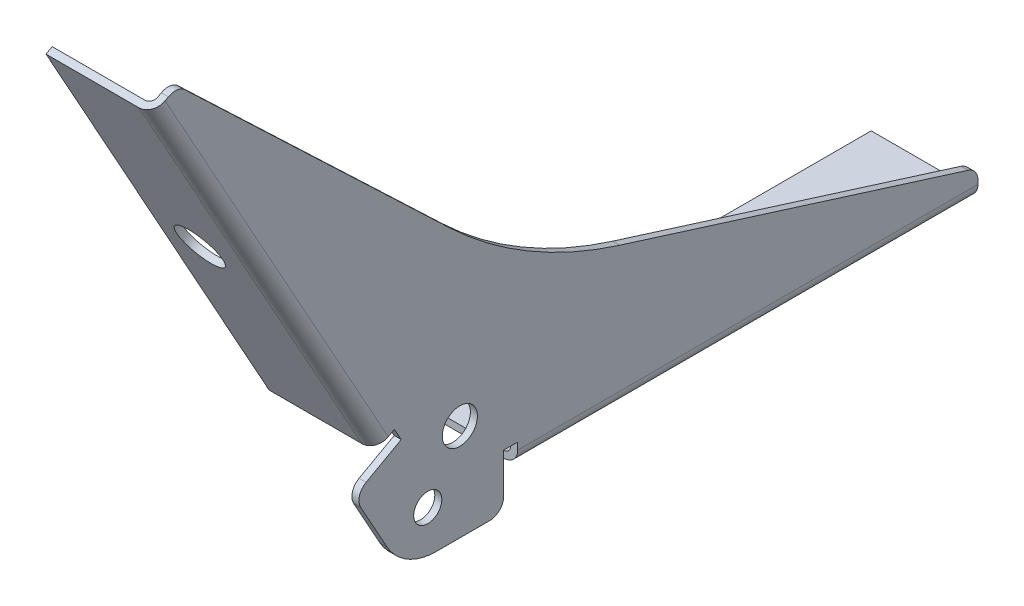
ISO-10303-21;
HEADER;
FILE_DESCRIPTION(('STEP AP214'),'2;1');
FILE_NAME('part.step','',(''),(''),'','','');
FILE_SCHEMA(('AUTOMOTIVE_DESIGN { 1 0 10303 214 1 1 1 1 }'));
ENDSEC;
DATA;
#1=APPLICATION_CONTEXT('core data for automotive mechanical design processes');
#2=APPLICATION_PROTOCOL_DEFINITION('international standard','automotive_design',2000,#1);
#3=PRODUCT_CONTEXT('',#1,'mechanical');
#4=PRODUCT('Part','Part','',(#3));
#5=PRODUCT_RELATED_PRODUCT_CATEGORY('part','',(#4));
#6=PRODUCT_DEFINITION_FORMATION('','',#4);
#7=PRODUCT_DEFINITION_CONTEXT('part definition',#1,'design');
#8=PRODUCT_DEFINITION('design','',#6,#7);
#9=PRODUCT_DEFINITION_SHAPE('','',#8);
#10=(LENGTH_UNIT() NAMED_UNIT(*) SI_UNIT(.MILLI.,.METRE.));
#11=(NAMED_UNIT(*) PLANE_ANGLE_UNIT() SI_UNIT($,.RADIAN.));
#12=(NAMED_UNIT(*) SI_UNIT($,.STERADIAN.) SOLID_ANGLE_UNIT());
#13=UNCERTAINTY_MEASURE_WITH_UNIT(LENGTH_MEASURE(1.E-05),#10,'distance_accuracy_value','');
#14=(GEOMETRIC_REPRESENTATION_CONTEXT(3) GLOBAL_UNCERTAINTY_ASSIGNED_CONTEXT((#13)) GLOBAL_UNIT_ASSIGNED_CONTEXT((#10,
#11,#12)) REPRESENTATION_CONTEXT('',''));
#15=CARTESIAN_POINT('',(0.,0.,0.));
#16=DIRECTION('',(0.,0.,1.));
#17=DIRECTION('',(1.,0.,0.));
#18=AXIS2_PLACEMENT_3D('',#15,#16,#17);
#19=CARTESIAN_POINT('',(14.2,-3.7,-9.));
#20=DIRECTION('',(-1.,0.,0.));
#21=DIRECTION('',(0.,0.,1.));
#22=AXIS2_PLACEMENT_3D('',#19,#20,#21);
#23=PLANE('',#22);
#24=CARTESIAN_POINT('',(14.2,0.331404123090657,-0.195211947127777));
#25=DIRECTION('',(1.,0.,0.));
#26=DIRECTION('',(0.,0.,-1.));
#27=AXIS2_PLACEMENT_3D('',#24,#25,#26);
#28=CIRCLE('',#27,2.);
#29=CARTESIAN_POINT('',(14.2,0.331404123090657,-2.19521194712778));
#30=VERTEX_POINT('',#29);
#31=EDGE_CURVE('E264',#30,#30,#28,.T.);
#32=ORIENTED_EDGE('',*,*,#31,.T.);
#33=EDGE_LOOP('',(#32));
#34=FACE_BOUND('',#33,.T.);
#35=CARTESIAN_POINT('',(14.2,8.08606656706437,-4.76305721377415));
#36=DIRECTION('',(1.,0.,0.));
#37=DIRECTION('',(0.,0.,-1.));
#38=AXIS2_PLACEMENT_3D('',#35,#36,#37);
#39=CIRCLE('',#38,2.5);
#40=CARTESIAN_POINT('',(14.2,8.08606656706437,-7.26305721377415));
#41=VERTEX_POINT('',#40);
#42=EDGE_CURVE('E258',#41,#41,#39,.T.);
#43=ORIENTED_EDGE('',*,*,#42,.T.);
#44=EDGE_LOOP('',(#43));
#45=FACE_BOUND('',#44,.T.);
#46=DIRECTION('',(0.,0.484809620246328,-0.874619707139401));
#47=VECTOR('',#46,1.);
#48=CARTESIAN_POINT('',(14.2,10.8852465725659,7.17714477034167));
#49=LINE('',#48,#47);
#50=CARTESIAN_POINT('',(14.2,11.8548658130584,5.42790535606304));
#51=VERTEX_POINT('',#50);
#52=CARTESIAN_POINT('',(14.2,12.3396754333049,4.55328564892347));
#53=VERTEX_POINT('',#52);
#54=EDGE_CURVE('E293',#51,#53,#49,.T.);
#55=ORIENTED_EDGE('',*,*,#54,.F.);
#56=DIRECTION('',(0.,0.874619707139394,0.484809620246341));
#57=VECTOR('',#56,1.);
#58=CARTESIAN_POINT('',(14.2,-6.16175745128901,-4.55887199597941));
#59=LINE('',#58,#57);
#60=CARTESIAN_POINT('',(14.2,69.1424566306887,37.1829354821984));
#61=VERTEX_POINT('',#60);
#62=EDGE_CURVE('E446',#51,#61,#59,.T.);
#63=ORIENTED_EDGE('',*,*,#62,.T.);
#64=DIRECTION('',(0.,-0.484809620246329,0.874619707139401));
#65=VECTOR('',#64,1.);
#66=CARTESIAN_POINT('',(14.2,68.1728373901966,38.9321748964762));
#67=LINE('',#66,#65);
#68=CARTESIAN_POINT('',(14.2,69.4000538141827,36.7182178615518));
#69=VERTEX_POINT('',#68);
#70=EDGE_CURVE('E290',#69,#61,#67,.T.);
#71=ORIENTED_EDGE('',*,*,#70,.F.);
#72=CARTESIAN_POINT('',(14.2,67.650814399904,35.7485986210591));
#73=DIRECTION('',(1.,0.,0.));
#74=DIRECTION('',(0.,0.,-1.));
#75=AXIS2_PLACEMENT_3D('',#72,#73,#74);
#76=CIRCLE('',#75,1.99999999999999);
#77=CARTESIAN_POINT('',(14.2,69.0995906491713,34.3698138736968));
#78=VERTEX_POINT('',#77);
#79=EDGE_CURVE('E287',#78,#69,#76,.T.);
#80=ORIENTED_EDGE('',*,*,#79,.F.);
#81=DIRECTION('',(0.,0.689392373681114,0.724388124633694));
#82=VECTOR('',#81,1.);
#83=CARTESIAN_POINT('',(14.2,69.0995906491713,34.3698138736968));
#84=LINE('',#83,#82);
#85=CARTESIAN_POINT('',(14.2,33.2634247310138,-3.28550987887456));
#86=VERTEX_POINT('',#85);
#87=EDGE_CURVE('E284',#86,#78,#84,.T.);
#88=ORIENTED_EDGE('',*,*,#87,.F.);
#89=CARTESIAN_POINT('',(14.2,78.2335200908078,-46.083065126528));
#90=DIRECTION('',(-1.,0.,0.));
#91=DIRECTION('',(0.,0.,-1.));
#92=AXIS2_PLACEMENT_3D('',#89,#90,#91);
#93=CIRCLE('',#92,62.080111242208);
#94=CARTESIAN_POINT('',(14.2,19.,-27.5));
#95=VERTEX_POINT('',#94);
#96=EDGE_CURVE('E281',#95,#86,#93,.T.);
#97=ORIENTED_EDGE('',*,*,#96,.F.);
#98=DIRECTION('',(0.,0.299340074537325,0.954146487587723));
#99=VECTOR('',#98,1.);
#100=CARTESIAN_POINT('',(14.2,3.43962975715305,-77.0986801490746));
#101=LINE('',#100,#99);
#102=CARTESIAN_POINT('',(14.2,3.43962975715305,-77.0986801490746));
#103=VERTEX_POINT('',#102);
#104=EDGE_CURVE('E278',#103,#95,#101,.T.);
#105=ORIENTED_EDGE('',*,*,#104,.F.);
#106=CARTESIAN_POINT('',(14.2,1.5313367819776,-76.5));
#107=DIRECTION('',(1.,0.,0.));
#108=DIRECTION('',(0.,0.,-1.));
#109=AXIS2_PLACEMENT_3D('',#106,#107,#108);
#110=CIRCLE('',#109,2.);
#111=CARTESIAN_POINT('',(14.2,1.53133678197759,-78.5));
#112=VERTEX_POINT('',#111);
#113=EDGE_CURVE('E275',#112,#103,#110,.T.);
#114=ORIENTED_EDGE('',*,*,#113,.F.);
#115=DIRECTION('',(0.,1.,0.));
#116=VECTOR('',#115,1.);
#117=CARTESIAN_POINT('',(14.2,-1.,-78.5));
#118=LINE('',#117,#116);
#119=CARTESIAN_POINT('',(14.2,1.,-78.5));
#120=VERTEX_POINT('',#119);
#121=EDGE_CURVE('E272',#120,#112,#118,.T.);
#122=ORIENTED_EDGE('',*,*,#121,.F.);
#123=DIRECTION('',(0.,0.,-1.));
#124=VECTOR('',#123,1.);
#125=CARTESIAN_POINT('',(14.2,1.,-9.));
#126=LINE('',#125,#124);
#127=CARTESIAN_POINT('',(14.2,1.,-13.));
#128=VERTEX_POINT('',#127);
#129=EDGE_CURVE('E444',#120,#128,#126,.F.);
#130=ORIENTED_EDGE('',*,*,#129,.T.);
#131=DIRECTION('',(0.,-1.,0.));
#132=VECTOR('',#131,1.);
#133=CARTESIAN_POINT('',(14.2,-1.,-13.));
#134=LINE('',#133,#132);
#135=CARTESIAN_POINT('',(14.2,2.,-13.));
#136=VERTEX_POINT('',#135);
#137=EDGE_CURVE('E270',#136,#128,#134,.T.);
#138=ORIENTED_EDGE('',*,*,#137,.F.);
#139=DIRECTION('',(0.,0.,-1.));
#140=VECTOR('',#139,1.);
#141=CARTESIAN_POINT('',(14.2,2.,-13.));
#142=LINE('',#141,#140);
#143=CARTESIAN_POINT('',(14.2,2.,-11.));
#144=VERTEX_POINT('',#143);
#145=EDGE_CURVE('E319',#144,#136,#142,.T.);
#146=ORIENTED_EDGE('',*,*,#145,.F.);
#147=DIRECTION('',(0.,1.,0.));
#148=VECTOR('',#147,1.);
#149=CARTESIAN_POINT('',(14.2,2.,-11.));
#150=LINE('',#149,#148);
#151=CARTESIAN_POINT('',(14.2,-3.69999999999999,-11.));
#152=VERTEX_POINT('',#151);
#153=EDGE_CURVE('E316',#152,#144,#150,.T.);
#154=ORIENTED_EDGE('',*,*,#153,.F.);
#155=CARTESIAN_POINT('',(14.2,-3.7,-9.));
#156=DIRECTION('',(1.,0.,0.));
#157=DIRECTION('',(0.,0.,1.));
#158=AXIS2_PLACEMENT_3D('',#155,#156,#157);
#159=CIRCLE('',#158,2.);
#160=CARTESIAN_POINT('',(14.2,-5.7,-8.99999999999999));
#161=VERTEX_POINT('',#160);
#162=EDGE_CURVE('E313',#161,#152,#159,.T.);
#163=ORIENTED_EDGE('',*,*,#162,.F.);
#164=DIRECTION('',(0.,0.,-1.));
#165=VECTOR('',#164,1.);
#166=CARTESIAN_POINT('',(14.2,-5.7,-8.99999999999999));
#167=LINE('',#166,#165);
#168=CARTESIAN_POINT('',(14.2,-5.7,-1.35480353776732));
#169=VERTEX_POINT('',#168);
#170=EDGE_CURVE('E310',#169,#161,#167,.T.);
#171=ORIENTED_EDGE('',*,*,#170,.F.);
#172=CARTESIAN_POINT('',(14.2,2.3,-1.35480353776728));
#173=DIRECTION('',(1.,0.,0.));
#174=DIRECTION('',(0.,0.,1.));
#175=AXIS2_PLACEMENT_3D('',#172,#173,#174);
#176=CIRCLE('',#175,8.);
#177=CARTESIAN_POINT('',(14.2,-1.5784769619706,5.64215411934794));
#178=VERTEX_POINT('',#177);
#179=EDGE_CURVE('E307',#178,#169,#176,.T.);
#180=ORIENTED_EDGE('',*,*,#179,.F.);
#181=DIRECTION('',(0.,-0.874619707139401,-0.484809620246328));
#182=VECTOR('',#181,1.);
#183=CARTESIAN_POINT('',(14.2,5.10816252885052,9.34861891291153));
#184=LINE('',#183,#182);
#185=CARTESIAN_POINT('',(14.2,5.10816252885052,9.34861891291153));
#186=VERTEX_POINT('',#185);
#187=EDGE_CURVE('E304',#186,#178,#184,.T.);
#188=ORIENTED_EDGE('',*,*,#187,.F.);
#189=CARTESIAN_POINT('',(14.2,6.07778176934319,7.59937949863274));
#190=DIRECTION('',(1.,0.,0.));
#191=DIRECTION('',(0.,0.,-1.));
#192=AXIS2_PLACEMENT_3D('',#189,#190,#191);
#193=CIRCLE('',#192,2.);
#194=CARTESIAN_POINT('',(14.2,7.827021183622,8.56899873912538));
#195=VERTEX_POINT('',#194);
#196=EDGE_CURVE('E301',#195,#186,#193,.T.);
#197=ORIENTED_EDGE('',*,*,#196,.F.);
#198=DIRECTION('',(0.,-0.484809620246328,0.874619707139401));
#199=VECTOR('',#198,1.);
#200=CARTESIAN_POINT('',(14.2,10.5904360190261,3.58366640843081));
#201=LINE('',#200,#199);
#202=CARTESIAN_POINT('',(14.2,10.5904360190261,3.58366640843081));
#203=VERTEX_POINT('',#202);
#204=EDGE_CURVE('E298',#203,#195,#201,.T.);
#205=ORIENTED_EDGE('',*,*,#204,.F.);
#206=DIRECTION('',(0.,-0.8746197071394,-0.484809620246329));
#207=VECTOR('',#206,1.);
#208=CARTESIAN_POINT('',(14.2,12.3396754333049,4.55328564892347));
#209=LINE('',#208,#207);
#210=EDGE_CURVE('E295',#53,#203,#209,.T.);
#211=ORIENTED_EDGE('',*,*,#210,.F.);
#212=EDGE_LOOP('',(#55,#63,#71,#80,#88,#97,#105,#114,#122,#130,#138,#146,#154,#163,#171,#180,
#188,#197,#205,#211));
#213=FACE_BOUND('',#212,.T.);
#214=ADVANCED_FACE('F34',(#34,#45,#213),#23,.T.);
#215=CARTESIAN_POINT('',(15.2,-1.,-13.));
#216=DIRECTION('',(0.,0.,-1.));
#217=DIRECTION('',(-1.,0.,0.));
#218=AXIS2_PLACEMENT_3D('',#215,#216,#217);
#219=PLANE('',#218);
#220=DIRECTION('',(-1.,0.,0.));
#221=VECTOR('',#220,1.);
#222=CARTESIAN_POINT('',(15.2,-1.,-13.));
#223=LINE('',#222,#221);
#224=CARTESIAN_POINT('',(13.2,-1.,-13.));
#225=VERTEX_POINT('',#224);
#226=CARTESIAN_POINT('',(0.,-1.,-13.));
#227=VERTEX_POINT('',#226);
#228=EDGE_CURVE('E425',#225,#227,#223,.T.);
#229=ORIENTED_EDGE('',*,*,#228,.F.);
#230=CARTESIAN_POINT('',(13.2,0.999999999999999,-13.));
#231=DIRECTION('',(0.,0.,-1.));
#232=DIRECTION('',(-1.,0.,0.));
#233=AXIS2_PLACEMENT_3D('',#230,#231,#232);
#234=CIRCLE('',#233,2.);
#235=CARTESIAN_POINT('',(15.2,0.999999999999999,-13.));
#236=VERTEX_POINT('',#235);
#237=EDGE_CURVE('E442',#225,#236,#234,.F.);
#238=ORIENTED_EDGE('',*,*,#237,.T.);
#239=DIRECTION('',(0.,-1.,0.));
#240=VECTOR('',#239,1.);
#241=CARTESIAN_POINT('',(15.2,-1.,-13.));
#242=LINE('',#241,#240);
#243=CARTESIAN_POINT('',(15.2,2.,-13.));
#244=VERTEX_POINT('',#243);
#245=EDGE_CURVE('E403',#244,#236,#242,.T.);
#246=ORIENTED_EDGE('',*,*,#245,.F.);
#247=DIRECTION('',(1.,0.,0.));
#248=VECTOR('',#247,1.);
#249=CARTESIAN_POINT('',(14.2,2.,-13.));
#250=LINE('',#249,#248);
#251=EDGE_CURVE('E368',#136,#244,#250,.T.);
#252=ORIENTED_EDGE('',*,*,#251,.F.);
#253=ORIENTED_EDGE('',*,*,#137,.T.);
#254=CARTESIAN_POINT('',(13.2,1.,-13.));
#255=DIRECTION('',(0.,0.,-1.));
#256=DIRECTION('',(-1.,0.,0.));
#257=AXIS2_PLACEMENT_3D('',#254,#255,#256);
#258=CIRCLE('',#257,1.);
#259=CARTESIAN_POINT('',(13.2,0.,-13.));
#260=VERTEX_POINT('',#259);
#261=EDGE_CURVE('E11',#128,#260,#258,.T.);
#262=ORIENTED_EDGE('',*,*,#261,.T.);
#263=DIRECTION('',(-1.,0.,0.));
#264=VECTOR('',#263,1.);
#265=CARTESIAN_POINT('',(15.2,0.,-13.));
#266=LINE('',#265,#264);
#267=CARTESIAN_POINT('',(0.,0.,-13.));
#268=VERTEX_POINT('',#267);
#269=EDGE_CURVE('E409',#260,#268,#266,.T.);
#270=ORIENTED_EDGE('',*,*,#269,.T.);
#271=DIRECTION('',(0.,-1.,0.));
#272=VECTOR('',#271,1.);
#273=CARTESIAN_POINT('',(0.,-1.,-13.));
#274=LINE('',#273,#272);
#275=EDGE_CURVE('E371',#268,#227,#274,.T.);
#276=ORIENTED_EDGE('',*,*,#275,.T.);
#277=EDGE_LOOP('',(#229,#238,#246,#252,#253,#262,#270,#276));
#278=FACE_BOUND('',#277,.T.);
#279=ADVANCED_FACE('F472',(#278),#219,.F.);
#280=CARTESIAN_POINT('',(15.2,-1.,-13.));
#281=DIRECTION('',(0.,1.,0.));
#282=DIRECTION('',(0.,0.,1.));
#283=AXIS2_PLACEMENT_3D('',#280,#281,#282);
#284=PLANE('',#283);
#285=CARTESIAN_POINT('',(6.,-1.,-45.75));
#286=DIRECTION('',(0.,1.,0.));
#287=DIRECTION('',(0.,0.,1.));
#288=AXIS2_PLACEMENT_3D('',#285,#286,#287);
#289=CIRCLE('',#288,3.3);
#290=CARTESIAN_POINT('',(6.,-1.,-42.45));
#291=VERTEX_POINT('',#290);
#292=EDGE_CURVE('E785',#291,#291,#289,.T.);
#293=ORIENTED_EDGE('',*,*,#292,.T.);
#294=EDGE_LOOP('',(#293));
#295=FACE_BOUND('',#294,.T.);
#296=DIRECTION('',(-1.,0.,0.));
#297=VECTOR('',#296,1.);
#298=CARTESIAN_POINT('',(15.2,-1.,-78.5));
#299=LINE('',#298,#297);
#300=CARTESIAN_POINT('',(13.2,-1.,-78.5));
#301=VERTEX_POINT('',#300);
#302=CARTESIAN_POINT('',(0.,-1.,-78.5));
#303=VERTEX_POINT('',#302);
#304=EDGE_CURVE('E423',#301,#303,#299,.T.);
#305=ORIENTED_EDGE('',*,*,#304,.F.);
#306=DIRECTION('',(0.,0.,-1.));
#307=VECTOR('',#306,1.);
#308=CARTESIAN_POINT('',(13.2,-1.,-13.));
#309=LINE('',#308,#307);
#310=EDGE_CURVE('E440',#301,#225,#309,.F.);
#311=ORIENTED_EDGE('',*,*,#310,.T.);
#312=ORIENTED_EDGE('',*,*,#228,.T.);
#313=DIRECTION('',(0.,0.,-1.));
#314=VECTOR('',#313,1.);
#315=CARTESIAN_POINT('',(0.,-1.,-13.));
#316=LINE('',#315,#314);
#317=EDGE_CURVE('E412',#227,#303,#316,.T.);
#318=ORIENTED_EDGE('',*,*,#317,.T.);
#319=EDGE_LOOP('',(#305,#311,#312,#318));
#320=FACE_BOUND('',#319,.T.);
#321=ADVANCED_FACE('F480',(#295,#320),#284,.F.);
#322=CARTESIAN_POINT('',(15.2,-1.,-78.5));
#323=DIRECTION('',(0.,0.,1.));
#324=DIRECTION('',(0.,-1.,0.));
#325=AXIS2_PLACEMENT_3D('',#322,#323,#324);
#326=PLANE('',#325);
#327=DIRECTION('',(0.,1.,0.));
#328=VECTOR('',#327,1.);
#329=CARTESIAN_POINT('',(15.2,-1.,-78.5));
#330=LINE('',#329,#328);
#331=CARTESIAN_POINT('',(15.2,0.999999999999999,-78.5));
#332=VERTEX_POINT('',#331);
#333=CARTESIAN_POINT('',(15.2,1.53133678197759,-78.5));
#334=VERTEX_POINT('',#333);
#335=EDGE_CURVE('E406',#332,#334,#330,.T.);
#336=ORIENTED_EDGE('',*,*,#335,.F.);
#337=CARTESIAN_POINT('',(13.2,0.999999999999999,-78.5));
#338=DIRECTION('',(0.,0.,1.));
#339=DIRECTION('',(0.,-1.,0.));
#340=AXIS2_PLACEMENT_3D('',#337,#338,#339);
#341=CIRCLE('',#340,2.);
#342=EDGE_CURVE('E438',#332,#301,#341,.F.);
#343=ORIENTED_EDGE('',*,*,#342,.T.);
#344=ORIENTED_EDGE('',*,*,#304,.T.);
#345=DIRECTION('',(0.,1.,0.));
#346=VECTOR('',#345,1.);
#347=CARTESIAN_POINT('',(0.,-1.,-78.5));
#348=LINE('',#347,#346);
#349=CARTESIAN_POINT('',(0.,0.,-78.5));
#350=VERTEX_POINT('',#349);
#351=EDGE_CURVE('E415',#303,#350,#348,.T.);
#352=ORIENTED_EDGE('',*,*,#351,.T.);
#353=DIRECTION('',(-1.,0.,0.));
#354=VECTOR('',#353,1.);
#355=CARTESIAN_POINT('',(15.2,0.,-78.5));
#356=LINE('',#355,#354);
#357=CARTESIAN_POINT('',(13.2,0.,-78.5));
#358=VERTEX_POINT('',#357);
#359=EDGE_CURVE('E421',#358,#350,#356,.T.);
#360=ORIENTED_EDGE('',*,*,#359,.F.);
#361=CARTESIAN_POINT('',(13.2,1.,-78.5));
#362=DIRECTION('',(0.,0.,1.));
#363=DIRECTION('',(0.,-1.,0.));
#364=AXIS2_PLACEMENT_3D('',#361,#362,#363);
#365=CIRCLE('',#364,1.);
#366=EDGE_CURVE('E42',#358,#120,#365,.T.);
#367=ORIENTED_EDGE('',*,*,#366,.T.);
#368=ORIENTED_EDGE('',*,*,#121,.T.);
#369=DIRECTION('',(1.,0.,0.));
#370=VECTOR('',#369,1.);
#371=CARTESIAN_POINT('',(14.2,1.53133678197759,-78.5));
#372=LINE('',#371,#370);
#373=EDGE_CURVE('E322',#112,#334,#372,.T.);
#374=ORIENTED_EDGE('',*,*,#373,.T.);
#375=EDGE_LOOP('',(#336,#343,#344,#352,#360,#367,#368,#374));
#376=FACE_BOUND('',#375,.T.);
#377=ADVANCED_FACE('F460',(#376),#326,.F.);
#378=CARTESIAN_POINT('',(15.2,0.,-13.));
#379=DIRECTION('',(0.,-1.,0.));
#380=DIRECTION('',(0.,0.,-1.));
#381=AXIS2_PLACEMENT_3D('',#378,#379,#380);
#382=PLANE('',#381);
#383=CARTESIAN_POINT('',(6.,0.,-45.75));
#384=DIRECTION('',(0.,1.,0.));
#385=DIRECTION('',(0.,0.,1.));
#386=AXIS2_PLACEMENT_3D('',#383,#384,#385);
#387=CIRCLE('',#386,3.3);
#388=CARTESIAN_POINT('',(6.,0.,-42.45));
#389=VERTEX_POINT('',#388);
#390=EDGE_CURVE('E788',#389,#389,#387,.T.);
#391=ORIENTED_EDGE('',*,*,#390,.F.);
#392=EDGE_LOOP('',(#391));
#393=FACE_BOUND('',#392,.T.);
#394=ORIENTED_EDGE('',*,*,#269,.F.);
#395=DIRECTION('',(0.,0.,-1.));
#396=VECTOR('',#395,1.);
#397=CARTESIAN_POINT('',(13.2,0.,-13.));
#398=LINE('',#397,#396);
#399=EDGE_CURVE('E451',#260,#358,#398,.T.);
#400=ORIENTED_EDGE('',*,*,#399,.T.);
#401=ORIENTED_EDGE('',*,*,#359,.T.);
#402=DIRECTION('',(0.,0.,1.));
#403=VECTOR('',#402,1.);
#404=CARTESIAN_POINT('',(0.,0.,-13.));
#405=LINE('',#404,#403);
#406=EDGE_CURVE('E407',#350,#268,#405,.T.);
#407=ORIENTED_EDGE('',*,*,#406,.T.);
#408=EDGE_LOOP('',(#394,#400,#401,#407));
#409=FACE_BOUND('',#408,.T.);
#410=ADVANCED_FACE('F468',(#393,#409),#382,.F.);
#411=CARTESIAN_POINT('',(15.2,0.,0.));
#412=DIRECTION('',(-1.,0.,0.));
#413=DIRECTION('',(0.,0.,1.));
#414=AXIS2_PLACEMENT_3D('',#411,#412,#413);
#415=PLANE('',#414);
#416=DIRECTION('',(0.,-0.484809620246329,0.874619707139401));
#417=VECTOR('',#416,1.);
#418=CARTESIAN_POINT('',(15.2,68.1728373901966,38.9321748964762));
#419=LINE('',#418,#417);
#420=CARTESIAN_POINT('',(15.2,69.4000538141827,36.7182178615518));
#421=VERTEX_POINT('',#420);
#422=CARTESIAN_POINT('',(15.2,69.1424566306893,37.1829354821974));
#423=VERTEX_POINT('',#422);
#424=EDGE_CURVE('E337',#421,#423,#419,.T.);
#425=ORIENTED_EDGE('',*,*,#424,.T.);
#426=DIRECTION('',(0.,-0.874619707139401,-0.484809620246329));
#427=VECTOR('',#426,1.);
#428=CARTESIAN_POINT('',(15.2,11.8548658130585,5.42790535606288));
#429=LINE('',#428,#427);
#430=CARTESIAN_POINT('',(15.2,11.8548658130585,5.42790535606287));
#431=VERTEX_POINT('',#430);
#432=EDGE_CURVE('E430',#423,#431,#429,.T.);
#433=ORIENTED_EDGE('',*,*,#432,.T.);
#434=DIRECTION('',(0.,0.484809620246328,-0.874619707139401));
#435=VECTOR('',#434,1.);
#436=CARTESIAN_POINT('',(15.2,10.8852465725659,7.17714477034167));
#437=LINE('',#436,#435);
#438=CARTESIAN_POINT('',(15.2,12.3396754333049,4.55328564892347));
#439=VERTEX_POINT('',#438);
#440=EDGE_CURVE('E340',#431,#439,#437,.T.);
#441=ORIENTED_EDGE('',*,*,#440,.T.);
#442=DIRECTION('',(0.,-0.8746197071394,-0.484809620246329));
#443=VECTOR('',#442,1.);
#444=CARTESIAN_POINT('',(15.2,12.3396754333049,4.55328564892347));
#445=LINE('',#444,#443);
#446=CARTESIAN_POINT('',(15.2,10.5904360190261,3.58366640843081));
#447=VERTEX_POINT('',#446);
#448=EDGE_CURVE('E342',#439,#447,#445,.T.);
#449=ORIENTED_EDGE('',*,*,#448,.T.);
#450=DIRECTION('',(0.,-0.484809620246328,0.874619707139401));
#451=VECTOR('',#450,1.);
#452=CARTESIAN_POINT('',(15.2,10.5904360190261,3.58366640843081));
#453=LINE('',#452,#451);
#454=CARTESIAN_POINT('',(15.2,7.827021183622,8.56899873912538));
#455=VERTEX_POINT('',#454);
#456=EDGE_CURVE('E345',#447,#455,#453,.T.);
#457=ORIENTED_EDGE('',*,*,#456,.T.);
#458=CARTESIAN_POINT('',(15.2,6.07778176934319,7.59937949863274));
#459=DIRECTION('',(1.,0.,0.));
#460=DIRECTION('',(0.,0.,-1.));
#461=AXIS2_PLACEMENT_3D('',#458,#459,#460);
#462=CIRCLE('',#461,2.);
#463=CARTESIAN_POINT('',(15.2,5.10816252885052,9.34861891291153));
#464=VERTEX_POINT('',#463);
#465=EDGE_CURVE('E348',#455,#464,#462,.T.);
#466=ORIENTED_EDGE('',*,*,#465,.T.);
#467=DIRECTION('',(0.,-0.874619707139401,-0.484809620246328));
#468=VECTOR('',#467,1.);
#469=CARTESIAN_POINT('',(15.2,5.10816252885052,9.34861891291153));
#470=LINE('',#469,#468);
#471=CARTESIAN_POINT('',(15.2,-1.5784769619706,5.64215411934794));
#472=VERTEX_POINT('',#471);
#473=EDGE_CURVE('E351',#464,#472,#470,.T.);
#474=ORIENTED_EDGE('',*,*,#473,.T.);
#475=CARTESIAN_POINT('',(15.2,2.3,-1.35480353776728));
#476=DIRECTION('',(1.,0.,0.));
#477=DIRECTION('',(0.,0.,1.));
#478=AXIS2_PLACEMENT_3D('',#475,#476,#477);
#479=CIRCLE('',#478,8.);
#480=CARTESIAN_POINT('',(15.2,-5.7,-1.35480353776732));
#481=VERTEX_POINT('',#480);
#482=EDGE_CURVE('E354',#472,#481,#479,.T.);
#483=ORIENTED_EDGE('',*,*,#482,.T.);
#484=DIRECTION('',(0.,0.,-1.));
#485=VECTOR('',#484,1.);
#486=CARTESIAN_POINT('',(15.2,-5.7,-8.99999999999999));
#487=LINE('',#486,#485);
#488=CARTESIAN_POINT('',(15.2,-5.7,-8.99999999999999));
#489=VERTEX_POINT('',#488);
#490=EDGE_CURVE('E357',#481,#489,#487,.T.);
#491=ORIENTED_EDGE('',*,*,#490,.T.);
#492=CARTESIAN_POINT('',(15.2,-3.7,-9.));
#493=DIRECTION('',(1.,0.,0.));
#494=DIRECTION('',(0.,0.,1.));
#495=AXIS2_PLACEMENT_3D('',#492,#493,#494);
#496=CIRCLE('',#495,2.);
#497=CARTESIAN_POINT('',(15.2,-3.69999999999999,-11.));
#498=VERTEX_POINT('',#497);
#499=EDGE_CURVE('E360',#489,#498,#496,.T.);
#500=ORIENTED_EDGE('',*,*,#499,.T.);
#501=DIRECTION('',(0.,1.,0.));
#502=VECTOR('',#501,1.);
#503=CARTESIAN_POINT('',(15.2,2.,-11.));
#504=LINE('',#503,#502);
#505=CARTESIAN_POINT('',(15.2,2.,-11.));
#506=VERTEX_POINT('',#505);
#507=EDGE_CURVE('E363',#498,#506,#504,.T.);
#508=ORIENTED_EDGE('',*,*,#507,.T.);
#509=DIRECTION('',(0.,0.,-1.));
#510=VECTOR('',#509,1.);
#511=CARTESIAN_POINT('',(15.2,2.,-13.));
#512=LINE('',#511,#510);
#513=EDGE_CURVE('E273',#506,#244,#512,.T.);
#514=ORIENTED_EDGE('',*,*,#513,.T.);
#515=ORIENTED_EDGE('',*,*,#245,.T.);
#516=DIRECTION('',(0.,0.,-1.));
#517=VECTOR('',#516,1.);
#518=CARTESIAN_POINT('',(15.2,0.999999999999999,0.));
#519=LINE('',#518,#517);
#520=EDGE_CURVE('E427',#236,#332,#519,.T.);
#521=ORIENTED_EDGE('',*,*,#520,.T.);
#522=ORIENTED_EDGE('',*,*,#335,.T.);
#523=CARTESIAN_POINT('',(15.2,1.5313367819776,-76.5));
#524=DIRECTION('',(1.,0.,0.));
#525=DIRECTION('',(0.,0.,-1.));
#526=AXIS2_PLACEMENT_3D('',#523,#524,#525);
#527=CIRCLE('',#526,2.);
#528=CARTESIAN_POINT('',(15.2,3.43962975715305,-77.0986801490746));
#529=VERTEX_POINT('',#528);
#530=EDGE_CURVE('E267',#334,#529,#527,.T.);
#531=ORIENTED_EDGE('',*,*,#530,.T.);
#532=DIRECTION('',(0.,0.299340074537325,0.954146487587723));
#533=VECTOR('',#532,1.);
#534=CARTESIAN_POINT('',(15.2,3.43962975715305,-77.0986801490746));
#535=LINE('',#534,#533);
#536=CARTESIAN_POINT('',(15.2,19.,-27.5));
#537=VERTEX_POINT('',#536);
#538=EDGE_CURVE('E325',#529,#537,#535,.T.);
#539=ORIENTED_EDGE('',*,*,#538,.T.);
#540=CARTESIAN_POINT('',(15.2,78.2335200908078,-46.083065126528));
#541=DIRECTION('',(-1.,0.,0.));
#542=DIRECTION('',(0.,0.,-1.));
#543=AXIS2_PLACEMENT_3D('',#540,#541,#542);
#544=CIRCLE('',#543,62.080111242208);
#545=CARTESIAN_POINT('',(15.2,33.2634247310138,-3.28550987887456));
#546=VERTEX_POINT('',#545);
#547=EDGE_CURVE('E328',#537,#546,#544,.T.);
#548=ORIENTED_EDGE('',*,*,#547,.T.);
#549=DIRECTION('',(0.,0.689392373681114,0.724388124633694));
#550=VECTOR('',#549,1.);
#551=CARTESIAN_POINT('',(15.2,69.0995906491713,34.3698138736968));
#552=LINE('',#551,#550);
#553=CARTESIAN_POINT('',(15.2,69.0995906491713,34.3698138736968));
#554=VERTEX_POINT('',#553);
#555=EDGE_CURVE('E331',#546,#554,#552,.T.);
#556=ORIENTED_EDGE('',*,*,#555,.T.);
#557=CARTESIAN_POINT('',(15.2,67.650814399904,35.7485986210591));
#558=DIRECTION('',(1.,0.,0.));
#559=DIRECTION('',(0.,0.,-1.));
#560=AXIS2_PLACEMENT_3D('',#557,#558,#559);
#561=CIRCLE('',#560,1.99999999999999);
#562=EDGE_CURVE('E334',#554,#421,#561,.T.);
#563=ORIENTED_EDGE('',*,*,#562,.T.);
#564=EDGE_LOOP('',(#425,#433,#441,#449,#457,#466,#474,#483,#491,#500,#508,#514,#515,#521,#522,
#531,#539,#548,#556,#563));
#565=FACE_BOUND('',#564,.T.);
#566=CARTESIAN_POINT('',(15.2,0.331404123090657,-0.195211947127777));
#567=DIRECTION('',(1.,0.,0.));
#568=DIRECTION('',(0.,0.,-1.));
#569=AXIS2_PLACEMENT_3D('',#566,#567,#568);
#570=CIRCLE('',#569,2.);
#571=CARTESIAN_POINT('',(15.2,0.331404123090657,-2.19521194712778));
#572=VERTEX_POINT('',#571);
#573=EDGE_CURVE('E261',#572,#572,#570,.T.);
#574=ORIENTED_EDGE('',*,*,#573,.F.);
#575=EDGE_LOOP('',(#574));
#576=FACE_BOUND('',#575,.T.);
#577=CARTESIAN_POINT('',(15.2,8.08606656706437,-4.76305721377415));
#578=DIRECTION('',(1.,0.,0.));
#579=DIRECTION('',(0.,0.,-1.));
#580=AXIS2_PLACEMENT_3D('',#577,#578,#579);
#581=CIRCLE('',#580,2.5);
#582=CARTESIAN_POINT('',(15.2,8.08606656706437,-7.26305721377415));
#583=VERTEX_POINT('',#582);
#584=EDGE_CURVE('E257',#583,#583,#581,.T.);
#585=ORIENTED_EDGE('',*,*,#584,.F.);
#586=EDGE_LOOP('',(#585));
#587=FACE_BOUND('',#586,.T.);
#588=ADVANCED_FACE('F486',(#565,#576,#587),#415,.F.);
#589=CARTESIAN_POINT('',(0.,0.,0.));
#590=DIRECTION('',(-1.,0.,0.));
#591=DIRECTION('',(0.,0.,1.));
#592=AXIS2_PLACEMENT_3D('',#589,#590,#591);
#593=PLANE('',#592);
#594=ORIENTED_EDGE('',*,*,#275,.F.);
#595=ORIENTED_EDGE('',*,*,#406,.F.);
#596=ORIENTED_EDGE('',*,*,#351,.F.);
#597=ORIENTED_EDGE('',*,*,#317,.F.);
#598=EDGE_LOOP('',(#594,#595,#596,#597));
#599=FACE_BOUND('',#598,.T.);
#600=ADVANCED_FACE('F476',(#599),#593,.T.);
#601=CARTESIAN_POINT('',(14.2,2.,-13.));
#602=DIRECTION('',(0.,-1.,0.));
#603=DIRECTION('',(0.,0.,-1.));
#604=AXIS2_PLACEMENT_3D('',#601,#602,#603);
#605=PLANE('',#604);
#606=ORIENTED_EDGE('',*,*,#513,.F.);
#607=DIRECTION('',(1.,0.,0.));
#608=VECTOR('',#607,1.);
#609=CARTESIAN_POINT('',(14.2,2.,-11.));
#610=LINE('',#609,#608);
#611=EDGE_CURVE('E372',#144,#506,#610,.T.);
#612=ORIENTED_EDGE('',*,*,#611,.F.);
#613=ORIENTED_EDGE('',*,*,#145,.T.);
#614=ORIENTED_EDGE('',*,*,#251,.T.);
#615=EDGE_LOOP('',(#606,#612,#613,#614));
#616=FACE_BOUND('',#615,.T.);
#617=ADVANCED_FACE('F491',(#616),#605,.T.);
#618=CARTESIAN_POINT('',(14.2,2.,-11.));
#619=DIRECTION('',(0.,0.,-1.));
#620=DIRECTION('',(0.,1.,0.));
#621=AXIS2_PLACEMENT_3D('',#618,#619,#620);
#622=PLANE('',#621);
#623=ORIENTED_EDGE('',*,*,#507,.F.);
#624=DIRECTION('',(1.,0.,0.));
#625=VECTOR('',#624,1.);
#626=CARTESIAN_POINT('',(14.2,-3.69999999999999,-11.));
#627=LINE('',#626,#625);
#628=EDGE_CURVE('E374',#152,#498,#627,.T.);
#629=ORIENTED_EDGE('',*,*,#628,.F.);
#630=ORIENTED_EDGE('',*,*,#153,.T.);
#631=ORIENTED_EDGE('',*,*,#611,.T.);
#632=EDGE_LOOP('',(#623,#629,#630,#631));
#633=FACE_BOUND('',#632,.T.);
#634=ADVANCED_FACE('F582',(#633),#622,.T.);
#635=CARTESIAN_POINT('',(14.2,-3.7,-9.));
#636=DIRECTION('',(1.,0.,0.));
#637=DIRECTION('',(0.,0.,-1.));
#638=AXIS2_PLACEMENT_3D('',#635,#636,#637);
#639=CYLINDRICAL_SURFACE('',#638,2.);
#640=ORIENTED_EDGE('',*,*,#499,.F.);
#641=DIRECTION('',(1.,0.,0.));
#642=VECTOR('',#641,1.);
#643=CARTESIAN_POINT('',(14.2,-5.7,-8.99999999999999));
#644=LINE('',#643,#642);
#645=EDGE_CURVE('E376',#161,#489,#644,.T.);
#646=ORIENTED_EDGE('',*,*,#645,.F.);
#647=ORIENTED_EDGE('',*,*,#162,.T.);
#648=ORIENTED_EDGE('',*,*,#628,.T.);
#649=EDGE_LOOP('',(#640,#646,#647,#648));
#650=FACE_BOUND('',#649,.T.);
#651=ADVANCED_FACE('F499',(#650),#639,.T.);
#652=CARTESIAN_POINT('',(14.2,-5.7,-8.99999999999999));
#653=DIRECTION('',(0.,-1.,0.));
#654=DIRECTION('',(0.,0.,-1.));
#655=AXIS2_PLACEMENT_3D('',#652,#653,#654);
#656=PLANE('',#655);
#657=ORIENTED_EDGE('',*,*,#490,.F.);
#658=DIRECTION('',(1.,0.,0.));
#659=VECTOR('',#658,1.);
#660=CARTESIAN_POINT('',(14.2,-5.7,-1.35480353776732));
#661=LINE('',#660,#659);
#662=EDGE_CURVE('E378',#169,#481,#661,.T.);
#663=ORIENTED_EDGE('',*,*,#662,.F.);
#664=ORIENTED_EDGE('',*,*,#170,.T.);
#665=ORIENTED_EDGE('',*,*,#645,.T.);
#666=EDGE_LOOP('',(#657,#663,#664,#665));
#667=FACE_BOUND('',#666,.T.);
#668=ADVANCED_FACE('F502',(#667),#656,.T.);
#669=CARTESIAN_POINT('',(14.2,2.3,-1.35480353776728));
#670=DIRECTION('',(1.,0.,0.));
#671=DIRECTION('',(0.,0.,-1.));
#672=AXIS2_PLACEMENT_3D('',#669,#670,#671);
#673=CYLINDRICAL_SURFACE('',#672,8.);
#674=ORIENTED_EDGE('',*,*,#482,.F.);
#675=DIRECTION('',(1.,0.,0.));
#676=VECTOR('',#675,1.);
#677=CARTESIAN_POINT('',(14.2,-1.5784769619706,5.64215411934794));
#678=LINE('',#677,#676);
#679=EDGE_CURVE('E380',#178,#472,#678,.T.);
#680=ORIENTED_EDGE('',*,*,#679,.F.);
#681=ORIENTED_EDGE('',*,*,#179,.T.);
#682=ORIENTED_EDGE('',*,*,#662,.T.);
#683=EDGE_LOOP('',(#674,#680,#681,#682));
#684=FACE_BOUND('',#683,.T.);
#685=ADVANCED_FACE('F507',(#684),#673,.T.);
#686=CARTESIAN_POINT('',(14.2,5.10816252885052,9.34861891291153));
#687=DIRECTION('',(0.,-0.484809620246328,0.874619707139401));
#688=DIRECTION('',(0.,-0.874619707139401,-0.484809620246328));
#689=AXIS2_PLACEMENT_3D('',#686,#687,#688);
#690=PLANE('',#689);
#691=ORIENTED_EDGE('',*,*,#473,.F.);
#692=DIRECTION('',(1.,0.,0.));
#693=VECTOR('',#692,1.);
#694=CARTESIAN_POINT('',(14.2,5.10816252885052,9.34861891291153));
#695=LINE('',#694,#693);
#696=EDGE_CURVE('E382',#186,#464,#695,.T.);
#697=ORIENTED_EDGE('',*,*,#696,.F.);
#698=ORIENTED_EDGE('',*,*,#187,.T.);
#699=ORIENTED_EDGE('',*,*,#679,.T.);
#700=EDGE_LOOP('',(#691,#697,#698,#699));
#701=FACE_BOUND('',#700,.T.);
#702=ADVANCED_FACE('F510',(#701),#690,.T.);
#703=CARTESIAN_POINT('',(14.2,6.07778176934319,7.59937949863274));
#704=DIRECTION('',(1.,0.,0.));
#705=DIRECTION('',(0.,0.,-1.));
#706=AXIS2_PLACEMENT_3D('',#703,#704,#705);
#707=CYLINDRICAL_SURFACE('',#706,2.);
#708=ORIENTED_EDGE('',*,*,#465,.F.);
#709=DIRECTION('',(1.,0.,0.));
#710=VECTOR('',#709,1.);
#711=CARTESIAN_POINT('',(14.2,7.827021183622,8.56899873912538));
#712=LINE('',#711,#710);
#713=EDGE_CURVE('E384',#195,#455,#712,.T.);
#714=ORIENTED_EDGE('',*,*,#713,.F.);
#715=ORIENTED_EDGE('',*,*,#196,.T.);
#716=ORIENTED_EDGE('',*,*,#696,.T.);
#717=EDGE_LOOP('',(#708,#714,#715,#716));
#718=FACE_BOUND('',#717,.T.);
#719=ADVANCED_FACE('F515',(#718),#707,.T.);
#720=CARTESIAN_POINT('',(14.2,10.5904360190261,3.58366640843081));
#721=DIRECTION('',(0.,0.874619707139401,0.484809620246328));
#722=DIRECTION('',(0.,-0.484809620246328,0.874619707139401));
#723=AXIS2_PLACEMENT_3D('',#720,#721,#722);
#724=PLANE('',#723);
#725=ORIENTED_EDGE('',*,*,#456,.F.);
#726=DIRECTION('',(1.,0.,0.));
#727=VECTOR('',#726,1.);
#728=CARTESIAN_POINT('',(14.2,10.5904360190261,3.58366640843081));
#729=LINE('',#728,#727);
#730=EDGE_CURVE('E386',#203,#447,#729,.T.);
#731=ORIENTED_EDGE('',*,*,#730,.F.);
#732=ORIENTED_EDGE('',*,*,#204,.T.);
#733=ORIENTED_EDGE('',*,*,#713,.T.);
#734=EDGE_LOOP('',(#725,#731,#732,#733));
#735=FACE_BOUND('',#734,.T.);
#736=ADVANCED_FACE('F518',(#735),#724,.T.);
#737=CARTESIAN_POINT('',(14.2,12.3396754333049,4.55328564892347));
#738=DIRECTION('',(0.,-0.484809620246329,0.8746197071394));
#739=DIRECTION('',(0.,-0.8746197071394,-0.484809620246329));
#740=AXIS2_PLACEMENT_3D('',#737,#738,#739);
#741=PLANE('',#740);
#742=ORIENTED_EDGE('',*,*,#448,.F.);
#743=DIRECTION('',(1.,0.,0.));
#744=VECTOR('',#743,1.);
#745=CARTESIAN_POINT('',(14.2,12.3396754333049,4.55328564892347));
#746=LINE('',#745,#744);
#747=EDGE_CURVE('E229',#53,#439,#746,.T.);
#748=ORIENTED_EDGE('',*,*,#747,.F.);
#749=ORIENTED_EDGE('',*,*,#210,.T.);
#750=ORIENTED_EDGE('',*,*,#730,.T.);
#751=EDGE_LOOP('',(#742,#748,#749,#750));
#752=FACE_BOUND('',#751,.T.);
#753=ADVANCED_FACE('F523',(#752),#741,.T.);
#754=CARTESIAN_POINT('',(14.2,10.8852465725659,7.17714477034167));
#755=DIRECTION('',(0.,-0.874619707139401,-0.484809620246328));
#756=DIRECTION('',(0.,0.484809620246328,-0.874619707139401));
#757=AXIS2_PLACEMENT_3D('',#754,#755,#756);
#758=PLANE('',#757);
#759=ORIENTED_EDGE('',*,*,#440,.F.);
#760=CARTESIAN_POINT('',(13.2,11.8548658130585,5.42790535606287));
#761=DIRECTION('',(0.,-0.874619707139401,-0.484809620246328));
#762=DIRECTION('',(0.,0.484809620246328,-0.874619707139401));
#763=AXIS2_PLACEMENT_3D('',#760,#761,#762);
#764=CIRCLE('',#763,2.);
#765=CARTESIAN_POINT('',(13.2,10.8852465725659,7.17714477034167));
#766=VERTEX_POINT('',#765);
#767=EDGE_CURVE('E225',#431,#766,#764,.T.);
#768=ORIENTED_EDGE('',*,*,#767,.T.);
#769=DIRECTION('',(1.,0.,0.));
#770=VECTOR('',#769,1.);
#771=CARTESIAN_POINT('',(14.2,10.8852465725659,7.17714477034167));
#772=LINE('',#771,#770);
#773=CARTESIAN_POINT('',(0.,10.8852465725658,7.17714477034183));
#774=VERTEX_POINT('',#773);
#775=EDGE_CURVE('E218',#774,#766,#772,.T.);
#776=ORIENTED_EDGE('',*,*,#775,.F.);
#777=DIRECTION('',(0.,0.48480962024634,-0.874619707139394));
#778=VECTOR('',#777,1.);
#779=CARTESIAN_POINT('',(0.,10.8852465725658,7.17714477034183));
#780=LINE('',#779,#778);
#781=CARTESIAN_POINT('',(0.,11.3700561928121,6.30252506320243));
#782=VERTEX_POINT('',#781);
#783=EDGE_CURVE('E223',#774,#782,#780,.T.);
#784=ORIENTED_EDGE('',*,*,#783,.T.);
#785=DIRECTION('',(-1.,0.,0.));
#786=VECTOR('',#785,1.);
#787=CARTESIAN_POINT('',(15.2,11.3700561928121,6.30252506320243));
#788=LINE('',#787,#786);
#789=CARTESIAN_POINT('',(13.2,11.3700561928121,6.30252506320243));
#790=VERTEX_POINT('',#789);
#791=EDGE_CURVE('E255',#790,#782,#788,.T.);
#792=ORIENTED_EDGE('',*,*,#791,.F.);
#793=CARTESIAN_POINT('',(13.2,11.8548658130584,5.42790535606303));
#794=DIRECTION('',(0.,-0.874619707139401,-0.484809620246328));
#795=DIRECTION('',(0.,0.484809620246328,-0.874619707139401));
#796=AXIS2_PLACEMENT_3D('',#793,#794,#795);
#797=CIRCLE('',#796,1.);
#798=EDGE_CURVE('E455',#790,#51,#797,.F.);
#799=ORIENTED_EDGE('',*,*,#798,.T.);
#800=ORIENTED_EDGE('',*,*,#54,.T.);
#801=ORIENTED_EDGE('',*,*,#747,.T.);
#802=EDGE_LOOP('',(#759,#768,#776,#784,#792,#799,#800,#801));
#803=FACE_BOUND('',#802,.T.);
#804=ADVANCED_FACE('F221',(#803),#758,.T.);
#805=CARTESIAN_POINT('',(14.2,10.8852465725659,7.17714477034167));
#806=DIRECTION('',(0.,-0.484809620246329,0.8746197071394));
#807=DIRECTION('',(0.,-0.874619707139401,-0.484809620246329));
#808=AXIS2_PLACEMENT_3D('',#805,#806,#807);
#809=PLANE('',#808);
#810=CARTESIAN_POINT('',(6.,39.5290419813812,23.0546598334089));
#811=DIRECTION('',(0.,-0.484809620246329,0.8746197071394));
#812=DIRECTION('',(0.,-0.874619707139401,-0.484809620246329));
#813=AXIS2_PLACEMENT_3D('',#810,#811,#812);
#814=CIRCLE('',#813,3.3);
#815=CARTESIAN_POINT('',(6.,36.6427969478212,21.454788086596));
#816=VERTEX_POINT('',#815);
#817=EDGE_CURVE('E243',#816,#816,#814,.T.);
#818=ORIENTED_EDGE('',*,*,#817,.F.);
#819=EDGE_LOOP('',(#818));
#820=FACE_BOUND('',#819,.T.);
#821=ORIENTED_EDGE('',*,*,#775,.T.);
#822=DIRECTION('',(0.,-0.874619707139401,-0.484809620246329));
#823=VECTOR('',#822,1.);
#824=CARTESIAN_POINT('',(13.2,68.1728373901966,38.9321748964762));
#825=LINE('',#824,#823);
#826=CARTESIAN_POINT('',(13.2,68.1728373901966,38.9321748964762));
#827=VERTEX_POINT('',#826);
#828=EDGE_CURVE('E434',#766,#827,#825,.F.);
#829=ORIENTED_EDGE('',*,*,#828,.T.);
#830=DIRECTION('',(1.,0.,0.));
#831=VECTOR('',#830,1.);
#832=CARTESIAN_POINT('',(14.2,68.1728373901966,38.9321748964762));
#833=LINE('',#832,#831);
#834=CARTESIAN_POINT('',(0.,68.1728373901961,38.9321748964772));
#835=VERTEX_POINT('',#834);
#836=EDGE_CURVE('E230',#835,#827,#833,.T.);
#837=ORIENTED_EDGE('',*,*,#836,.F.);
#838=DIRECTION('',(0.,-0.874619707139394,-0.484809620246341));
#839=VECTOR('',#838,1.);
#840=CARTESIAN_POINT('',(0.,10.8852465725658,7.17714477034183));
#841=LINE('',#840,#839);
#842=EDGE_CURVE('E236',#835,#774,#841,.T.);
#843=ORIENTED_EDGE('',*,*,#842,.T.);
#844=EDGE_LOOP('',(#821,#829,#837,#843));
#845=FACE_BOUND('',#844,.T.);
#846=ADVANCED_FACE('F240',(#820,#845),#809,.T.);
#847=CARTESIAN_POINT('',(14.2,68.1728373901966,38.9321748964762));
#848=DIRECTION('',(0.,0.874619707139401,0.484809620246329));
#849=DIRECTION('',(0.,-0.484809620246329,0.874619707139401));
#850=AXIS2_PLACEMENT_3D('',#847,#848,#849);
#851=PLANE('',#850);
#852=ORIENTED_EDGE('',*,*,#836,.T.);
#853=CARTESIAN_POINT('',(13.2,69.1424566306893,37.1829354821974));
#854=DIRECTION('',(0.,0.874619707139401,0.484809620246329));
#855=DIRECTION('',(0.,-0.484809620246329,0.874619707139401));
#856=AXIS2_PLACEMENT_3D('',#853,#854,#855);
#857=CIRCLE('',#856,2.);
#858=EDGE_CURVE('E436',#827,#423,#857,.T.);
#859=ORIENTED_EDGE('',*,*,#858,.T.);
#860=ORIENTED_EDGE('',*,*,#424,.F.);
#861=DIRECTION('',(1.,0.,0.));
#862=VECTOR('',#861,1.);
#863=CARTESIAN_POINT('',(14.2,69.4000538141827,36.7182178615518));
#864=LINE('',#863,#862);
#865=EDGE_CURVE('E391',#69,#421,#864,.T.);
#866=ORIENTED_EDGE('',*,*,#865,.F.);
#867=ORIENTED_EDGE('',*,*,#70,.T.);
#868=CARTESIAN_POINT('',(13.2,69.1424566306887,37.1829354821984));
#869=DIRECTION('',(0.,0.874619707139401,0.484809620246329));
#870=DIRECTION('',(0.,-0.484809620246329,0.874619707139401));
#871=AXIS2_PLACEMENT_3D('',#868,#869,#870);
#872=CIRCLE('',#871,1.);
#873=CARTESIAN_POINT('',(13.2,68.6576470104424,38.0575551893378));
#874=VERTEX_POINT('',#873);
#875=EDGE_CURVE('E453',#61,#874,#872,.F.);
#876=ORIENTED_EDGE('',*,*,#875,.T.);
#877=DIRECTION('',(-1.,0.,0.));
#878=VECTOR('',#877,1.);
#879=CARTESIAN_POINT('',(15.2,68.6576470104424,38.0575551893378));
#880=LINE('',#879,#878);
#881=CARTESIAN_POINT('',(0.,68.6576470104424,38.0575551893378));
#882=VERTEX_POINT('',#881);
#883=EDGE_CURVE('E253',#874,#882,#880,.T.);
#884=ORIENTED_EDGE('',*,*,#883,.T.);
#885=DIRECTION('',(0.,-0.484809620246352,0.874619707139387));
#886=VECTOR('',#885,1.);
#887=CARTESIAN_POINT('',(0.,68.1728373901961,38.9321748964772));
#888=LINE('',#887,#886);
#889=EDGE_CURVE('E251',#882,#835,#888,.T.);
#890=ORIENTED_EDGE('',*,*,#889,.T.);
#891=EDGE_LOOP('',(#852,#859,#860,#866,#867,#876,#884,#890));
#892=FACE_BOUND('',#891,.T.);
#893=ADVANCED_FACE('F532',(#892),#851,.T.);
#894=CARTESIAN_POINT('',(14.2,67.650814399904,35.7485986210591));
#895=DIRECTION('',(1.,0.,0.));
#896=DIRECTION('',(0.,0.,-1.));
#897=AXIS2_PLACEMENT_3D('',#894,#895,#896);
#898=CYLINDRICAL_SURFACE('',#897,1.99999999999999);
#899=ORIENTED_EDGE('',*,*,#562,.F.);
#900=DIRECTION('',(1.,0.,0.));
#901=VECTOR('',#900,1.);
#902=CARTESIAN_POINT('',(14.2,69.0995906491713,34.3698138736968));
#903=LINE('',#902,#901);
#904=EDGE_CURVE('E393',#78,#554,#903,.T.);
#905=ORIENTED_EDGE('',*,*,#904,.F.);
#906=ORIENTED_EDGE('',*,*,#79,.T.);
#907=ORIENTED_EDGE('',*,*,#865,.T.);
#908=EDGE_LOOP('',(#899,#905,#906,#907));
#909=FACE_BOUND('',#908,.T.);
#910=ADVANCED_FACE('F544',(#909),#898,.T.);
#911=CARTESIAN_POINT('',(14.2,69.0995906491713,34.3698138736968));
#912=DIRECTION('',(0.,0.724388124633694,-0.689392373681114));
#913=DIRECTION('',(0.,0.689392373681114,0.724388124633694));
#914=AXIS2_PLACEMENT_3D('',#911,#912,#913);
#915=PLANE('',#914);
#916=ORIENTED_EDGE('',*,*,#555,.F.);
#917=DIRECTION('',(1.,0.,0.));
#918=VECTOR('',#917,1.);
#919=CARTESIAN_POINT('',(14.2,33.2634247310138,-3.28550987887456));
#920=LINE('',#919,#918);
#921=EDGE_CURVE('E395',#86,#546,#920,.T.);
#922=ORIENTED_EDGE('',*,*,#921,.F.);
#923=ORIENTED_EDGE('',*,*,#87,.T.);
#924=ORIENTED_EDGE('',*,*,#904,.T.);
#925=EDGE_LOOP('',(#916,#922,#923,#924));
#926=FACE_BOUND('',#925,.T.);
#927=ADVANCED_FACE('F547',(#926),#915,.T.);
#928=CARTESIAN_POINT('',(14.2,78.2335200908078,-46.083065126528));
#929=DIRECTION('',(1.,0.,0.));
#930=DIRECTION('',(0.,0.,-1.));
#931=AXIS2_PLACEMENT_3D('',#928,#929,#930);
#932=CYLINDRICAL_SURFACE('',#931,62.080111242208);
#933=ORIENTED_EDGE('',*,*,#547,.F.);
#934=DIRECTION('',(1.,0.,0.));
#935=VECTOR('',#934,1.);
#936=CARTESIAN_POINT('',(14.2,19.,-27.5));
#937=LINE('',#936,#935);
#938=EDGE_CURVE('E397',#95,#537,#937,.T.);
#939=ORIENTED_EDGE('',*,*,#938,.F.);
#940=ORIENTED_EDGE('',*,*,#96,.T.);
#941=ORIENTED_EDGE('',*,*,#921,.T.);
#942=EDGE_LOOP('',(#933,#939,#940,#941));
#943=FACE_BOUND('',#942,.T.);
#944=ADVANCED_FACE('F551',(#943),#932,.F.);
#945=CARTESIAN_POINT('',(14.2,3.43962975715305,-77.0986801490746));
#946=DIRECTION('',(0.,0.954146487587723,-0.299340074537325));
#947=DIRECTION('',(0.,0.299340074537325,0.954146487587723));
#948=AXIS2_PLACEMENT_3D('',#945,#946,#947);
#949=PLANE('',#948);
#950=ORIENTED_EDGE('',*,*,#538,.F.);
#951=DIRECTION('',(1.,0.,0.));
#952=VECTOR('',#951,1.);
#953=CARTESIAN_POINT('',(14.2,3.43962975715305,-77.0986801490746));
#954=LINE('',#953,#952);
#955=EDGE_CURVE('E399',#103,#529,#954,.T.);
#956=ORIENTED_EDGE('',*,*,#955,.F.);
#957=ORIENTED_EDGE('',*,*,#104,.T.);
#958=ORIENTED_EDGE('',*,*,#938,.T.);
#959=EDGE_LOOP('',(#950,#956,#957,#958));
#960=FACE_BOUND('',#959,.T.);
#961=ADVANCED_FACE('F554',(#960),#949,.T.);
#962=CARTESIAN_POINT('',(14.2,1.5313367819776,-76.5));
#963=DIRECTION('',(1.,0.,0.));
#964=DIRECTION('',(0.,0.,-1.));
#965=AXIS2_PLACEMENT_3D('',#962,#963,#964);
#966=CYLINDRICAL_SURFACE('',#965,2.);
#967=ORIENTED_EDGE('',*,*,#530,.F.);
#968=ORIENTED_EDGE('',*,*,#373,.F.);
#969=ORIENTED_EDGE('',*,*,#113,.T.);
#970=ORIENTED_EDGE('',*,*,#955,.T.);
#971=EDGE_LOOP('',(#967,#968,#969,#970));
#972=FACE_BOUND('',#971,.T.);
#973=ADVANCED_FACE('F557',(#972),#966,.T.);
#974=CARTESIAN_POINT('',(14.2,0.331404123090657,-0.195211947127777));
#975=DIRECTION('',(1.,0.,0.));
#976=DIRECTION('',(0.,0.,-1.));
#977=AXIS2_PLACEMENT_3D('',#974,#975,#976);
#978=CYLINDRICAL_SURFACE('',#977,2.);
#979=ORIENTED_EDGE('',*,*,#31,.F.);
#980=EDGE_LOOP('',(#979));
#981=FACE_BOUND('',#980,.T.);
#982=ORIENTED_EDGE('',*,*,#573,.T.);
#983=EDGE_LOOP('',(#982));
#984=FACE_BOUND('',#983,.T.);
#985=ADVANCED_FACE('F559',(#981,#984),#978,.F.);
#986=CARTESIAN_POINT('',(14.2,8.08606656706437,-4.76305721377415));
#987=DIRECTION('',(1.,0.,0.));
#988=DIRECTION('',(0.,0.,-1.));
#989=AXIS2_PLACEMENT_3D('',#986,#987,#988);
#990=CYLINDRICAL_SURFACE('',#989,2.5);
#991=ORIENTED_EDGE('',*,*,#42,.F.);
#992=EDGE_LOOP('',(#991));
#993=FACE_BOUND('',#992,.T.);
#994=ORIENTED_EDGE('',*,*,#584,.T.);
#995=EDGE_LOOP('',(#994));
#996=FACE_BOUND('',#995,.T.);
#997=ADVANCED_FACE('F565',(#993,#996),#990,.F.);
#998=CARTESIAN_POINT('',(15.2,11.3700561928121,6.30252506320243));
#999=DIRECTION('',(0.,-0.484809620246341,0.874619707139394));
#1000=DIRECTION('',(0.,-0.874619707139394,-0.484809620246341));
#1001=AXIS2_PLACEMENT_3D('',#998,#999,#1000);
#1002=PLANE('',#1001);
#1003=CARTESIAN_POINT('',(6.,40.0138516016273,22.1800401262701));
#1004=DIRECTION('',(0.,0.484809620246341,-0.874619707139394));
#1005=DIRECTION('',(0.,0.874619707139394,0.484809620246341));
#1006=AXIS2_PLACEMENT_3D('',#1003,#1004,#1005);
#1007=CIRCLE('',#1006,3.3);
#1008=CARTESIAN_POINT('',(6.,42.9000966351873,23.779911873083));
#1009=VERTEX_POINT('',#1008);
#1010=EDGE_CURVE('E246',#1009,#1009,#1007,.T.);
#1011=ORIENTED_EDGE('',*,*,#1010,.F.);
#1012=EDGE_LOOP('',(#1011));
#1013=FACE_BOUND('',#1012,.T.);
#1014=ORIENTED_EDGE('',*,*,#883,.F.);
#1015=DIRECTION('',(0.,0.874619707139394,0.484809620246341));
#1016=VECTOR('',#1015,1.);
#1017=CARTESIAN_POINT('',(13.2,11.3700561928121,6.30252506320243));
#1018=LINE('',#1017,#1016);
#1019=EDGE_CURVE('E449',#874,#790,#1018,.F.);
#1020=ORIENTED_EDGE('',*,*,#1019,.T.);
#1021=ORIENTED_EDGE('',*,*,#791,.T.);
#1022=DIRECTION('',(0.,0.874619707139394,0.484809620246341));
#1023=VECTOR('',#1022,1.);
#1024=CARTESIAN_POINT('',(0.,11.3700561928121,6.30252506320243));
#1025=LINE('',#1024,#1023);
#1026=EDGE_CURVE('E238',#782,#882,#1025,.T.);
#1027=ORIENTED_EDGE('',*,*,#1026,.T.);
#1028=EDGE_LOOP('',(#1014,#1020,#1021,#1027));
#1029=FACE_BOUND('',#1028,.T.);
#1030=ADVANCED_FACE('F534',(#1013,#1029),#1002,.F.);
#1031=CARTESIAN_POINT('',(0.,0.,0.));
#1032=DIRECTION('',(-1.,0.,0.));
#1033=DIRECTION('',(0.,0.,1.));
#1034=AXIS2_PLACEMENT_3D('',#1031,#1032,#1033);
#1035=PLANE('',#1034);
#1036=ORIENTED_EDGE('',*,*,#842,.F.);
#1037=ORIENTED_EDGE('',*,*,#889,.F.);
#1038=ORIENTED_EDGE('',*,*,#1026,.F.);
#1039=ORIENTED_EDGE('',*,*,#783,.F.);
#1040=EDGE_LOOP('',(#1036,#1037,#1038,#1039));
#1041=FACE_BOUND('',#1040,.T.);
#1042=ADVANCED_FACE('F234',(#1041),#1035,.T.);
#1043=CARTESIAN_POINT('',(13.2,0.484809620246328,-0.874619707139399));
#1044=DIRECTION('',(0.,0.874619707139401,0.484809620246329));
#1045=DIRECTION('',(0.,-0.484809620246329,0.874619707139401));
#1046=AXIS2_PLACEMENT_3D('',#1043,#1044,#1045);
#1047=CYLINDRICAL_SURFACE('',#1046,2.);
#1048=ORIENTED_EDGE('',*,*,#858,.F.);
#1049=ORIENTED_EDGE('',*,*,#828,.F.);
#1050=ORIENTED_EDGE('',*,*,#767,.F.);
#1051=ORIENTED_EDGE('',*,*,#432,.F.);
#1052=EDGE_LOOP('',(#1048,#1049,#1050,#1051));
#1053=FACE_BOUND('',#1052,.T.);
#1054=ADVANCED_FACE('F539',(#1053),#1047,.T.);
#1055=CARTESIAN_POINT('',(13.2,0.999999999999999,0.));
#1056=DIRECTION('',(0.,0.,-1.));
#1057=DIRECTION('',(-1.,0.,0.));
#1058=AXIS2_PLACEMENT_3D('',#1055,#1056,#1057);
#1059=CYLINDRICAL_SURFACE('',#1058,2.);
#1060=ORIENTED_EDGE('',*,*,#237,.F.);
#1061=ORIENTED_EDGE('',*,*,#310,.F.);
#1062=ORIENTED_EDGE('',*,*,#342,.F.);
#1063=ORIENTED_EDGE('',*,*,#520,.F.);
#1064=EDGE_LOOP('',(#1060,#1061,#1062,#1063));
#1065=FACE_BOUND('',#1064,.T.);
#1066=ADVANCED_FACE('F483',(#1065),#1059,.T.);
#1067=CARTESIAN_POINT('',(13.2,-6.16175745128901,-4.5588719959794));
#1068=DIRECTION('',(0.,0.874619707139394,0.484809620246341));
#1069=DIRECTION('',(0.,-0.484809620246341,0.874619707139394));
#1070=AXIS2_PLACEMENT_3D('',#1067,#1068,#1069);
#1071=CYLINDRICAL_SURFACE('',#1070,1.);
#1072=ORIENTED_EDGE('',*,*,#798,.F.);
#1073=ORIENTED_EDGE('',*,*,#1019,.F.);
#1074=ORIENTED_EDGE('',*,*,#875,.F.);
#1075=ORIENTED_EDGE('',*,*,#62,.F.);
#1076=EDGE_LOOP('',(#1072,#1073,#1074,#1075));
#1077=FACE_BOUND('',#1076,.T.);
#1078=ADVANCED_FACE('F528',(#1077),#1071,.F.);
#1079=CARTESIAN_POINT('',(13.2,1.,-13.));
#1080=DIRECTION('',(0.,0.,-1.));
#1081=DIRECTION('',(-1.,0.,0.));
#1082=AXIS2_PLACEMENT_3D('',#1079,#1080,#1081);
#1083=CYLINDRICAL_SURFACE('',#1082,1.);
#1084=ORIENTED_EDGE('',*,*,#261,.F.);
#1085=ORIENTED_EDGE('',*,*,#129,.F.);
#1086=ORIENTED_EDGE('',*,*,#366,.F.);
#1087=ORIENTED_EDGE('',*,*,#399,.F.);
#1088=EDGE_LOOP('',(#1084,#1085,#1086,#1087));
#1089=FACE_BOUND('',#1088,.T.);
#1090=ADVANCED_FACE('F36',(#1089),#1083,.F.);
#1091=CARTESIAN_POINT('',(6.,22.1659431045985,54.3785193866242));
#1092=DIRECTION('',(0.,0.484809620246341,-0.874619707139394));
#1093=DIRECTION('',(0.,0.874619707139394,0.484809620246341));
#1094=AXIS2_PLACEMENT_3D('',#1091,#1092,#1093);
#1095=CYLINDRICAL_SURFACE('',#1094,3.3);
#1096=ORIENTED_EDGE('',*,*,#817,.T.);
#1097=EDGE_LOOP('',(#1096));
#1098=FACE_BOUND('',#1097,.T.);
#1099=ORIENTED_EDGE('',*,*,#1010,.T.);
#1100=EDGE_LOOP('',(#1099));
#1101=FACE_BOUND('',#1100,.T.);
#1102=ADVANCED_FACE('F731',(#1098,#1101),#1095,.F.);
#1103=CARTESIAN_POINT('',(6.,-1.,-45.75));
#1104=DIRECTION('',(0.,1.,0.));
#1105=DIRECTION('',(0.,0.,1.));
#1106=AXIS2_PLACEMENT_3D('',#1103,#1104,#1105);
#1107=CYLINDRICAL_SURFACE('',#1106,3.3);
#1108=ORIENTED_EDGE('',*,*,#292,.F.);
#1109=EDGE_LOOP('',(#1108));
#1110=FACE_BOUND('',#1109,.T.);
#1111=ORIENTED_EDGE('',*,*,#390,.T.);
#1112=EDGE_LOOP('',(#1111));
#1113=FACE_BOUND('',#1112,.T.);
#1114=ADVANCED_FACE('F752',(#1110,#1113),#1107,.F.);
#1115=CLOSED_SHELL('',(#214,#279,#321,#377,#410,#588,#600,#617,#634,#651,#668,#685,#702,#719,
#736,#753,#804,#846,#893,#910,#927,#944,#961,#973,#985,#997,#1030,#1042,#1054,#1066,#1078,#1090,
#1102,#1114));
#1116=MANIFOLD_SOLID_BREP('B2',#1115);
#1117=ADVANCED_BREP_SHAPE_REPRESENTATION('',(#18,#1116),#14);
#1118=SHAPE_DEFINITION_REPRESENTATION(#9,#1117);
ENDSEC;
END-ISO-10303-21;
